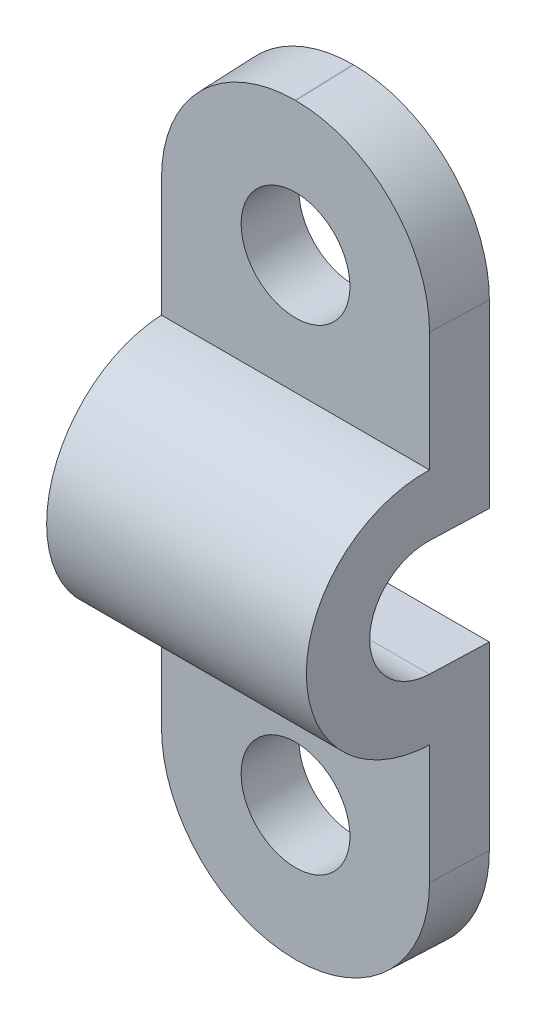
ISO-10303-21;
HEADER;
FILE_DESCRIPTION(('STEP AP214'),'2;1');
FILE_NAME('part.step','',(''),(''),'','','');
FILE_SCHEMA(('AUTOMOTIVE_DESIGN { 1 0 10303 214 1 1 1 1 }'));
ENDSEC;
DATA;
#1=APPLICATION_CONTEXT('core data for automotive mechanical design processes');
#2=APPLICATION_PROTOCOL_DEFINITION('international standard','automotive_design',2000,#1);
#3=PRODUCT_CONTEXT('',#1,'mechanical');
#4=PRODUCT('Part','Part','',(#3));
#5=PRODUCT_RELATED_PRODUCT_CATEGORY('part','',(#4));
#6=PRODUCT_DEFINITION_FORMATION('','',#4);
#7=PRODUCT_DEFINITION_CONTEXT('part definition',#1,'design');
#8=PRODUCT_DEFINITION('design','',#6,#7);
#9=PRODUCT_DEFINITION_SHAPE('','',#8);
#10=(LENGTH_UNIT() NAMED_UNIT(*) SI_UNIT(.MILLI.,.METRE.));
#11=(NAMED_UNIT(*) PLANE_ANGLE_UNIT() SI_UNIT($,.RADIAN.));
#12=(NAMED_UNIT(*) SI_UNIT($,.STERADIAN.) SOLID_ANGLE_UNIT());
#13=UNCERTAINTY_MEASURE_WITH_UNIT(LENGTH_MEASURE(1.E-05),#10,'distance_accuracy_value','');
#14=(GEOMETRIC_REPRESENTATION_CONTEXT(3) GLOBAL_UNCERTAINTY_ASSIGNED_CONTEXT((#13)) GLOBAL_UNIT_ASSIGNED_CONTEXT((#10,
#11,#12)) REPRESENTATION_CONTEXT('',''));
#15=CARTESIAN_POINT('',(0.,0.,0.));
#16=DIRECTION('',(0.,0.,1.));
#17=DIRECTION('',(1.,0.,0.));
#18=AXIS2_PLACEMENT_3D('',#15,#16,#17);
#19=CARTESIAN_POINT('',(94.47,-118.59,1.7085));
#20=DIRECTION('',(0.,0.,-1.));
#21=DIRECTION('',(-1.,0.,0.));
#22=AXIS2_PLACEMENT_3D('',#19,#20,#21);
#23=PLANE('',#22);
#24=DIRECTION('',(1.,0.,0.));
#25=VECTOR('',#24,1.);
#26=CARTESIAN_POINT('',(94.47,-118.530337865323,1.7085));
#27=LINE('',#26,#25);
#28=CARTESIAN_POINT('',(90.46005,-118.530337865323,1.7085));
#29=VERTEX_POINT('',#28);
#30=CARTESIAN_POINT('',(90.43995,-118.530337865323,1.7085));
#31=VERTEX_POINT('',#30);
#32=EDGE_CURVE('E196',#29,#31,#27,.F.);
#33=ORIENTED_EDGE('',*,*,#32,.F.);
#34=CARTESIAN_POINT('',(90.46005,-114.58005,1.7085));
#35=DIRECTION('',(0.,0.,-1.));
#36=DIRECTION('',(-1.,0.,0.));
#37=AXIS2_PLACEMENT_3D('',#34,#35,#36);
#38=CIRCLE('',#37,3.95028786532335);
#39=CARTESIAN_POINT('',(94.4103378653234,-114.58005,1.7085));
#40=VERTEX_POINT('',#39);
#41=EDGE_CURVE('E235',#29,#40,#38,.F.);
#42=ORIENTED_EDGE('',*,*,#41,.T.);
#43=DIRECTION('',(0.,-1.,0.));
#44=VECTOR('',#43,1.);
#45=CARTESIAN_POINT('',(94.4103378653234,-118.59,1.7085));
#46=LINE('',#45,#44);
#47=CARTESIAN_POINT('',(94.4103378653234,-111.0525,1.7085));
#48=VERTEX_POINT('',#47);
#49=EDGE_CURVE('E166',#48,#40,#46,.T.);
#50=ORIENTED_EDGE('',*,*,#49,.F.);
#51=DIRECTION('',(-1.,0.,0.));
#52=VECTOR('',#51,1.);
#53=CARTESIAN_POINT('',(94.47,-111.0525,1.7085));
#54=LINE('',#53,#52);
#55=CARTESIAN_POINT('',(86.4896621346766,-111.0525,1.7085));
#56=VERTEX_POINT('',#55);
#57=EDGE_CURVE('E269',#48,#56,#54,.T.);
#58=ORIENTED_EDGE('',*,*,#57,.T.);
#59=DIRECTION('',(0.,1.,0.));
#60=VECTOR('',#59,1.);
#61=CARTESIAN_POINT('',(86.4896621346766,-118.59,1.7085));
#62=LINE('',#61,#60);
#63=CARTESIAN_POINT('',(86.4896621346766,-114.58005,1.7085));
#64=VERTEX_POINT('',#63);
#65=EDGE_CURVE('E201',#56,#64,#62,.F.);
#66=ORIENTED_EDGE('',*,*,#65,.T.);
#67=CARTESIAN_POINT('',(90.43995,-114.58005,1.7085));
#68=DIRECTION('',(0.,0.,-1.));
#69=DIRECTION('',(-1.,0.,0.));
#70=AXIS2_PLACEMENT_3D('',#67,#68,#69);
#71=CIRCLE('',#70,3.95028786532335);
#72=EDGE_CURVE('E220',#64,#31,#71,.F.);
#73=ORIENTED_EDGE('',*,*,#72,.T.);
#74=EDGE_LOOP('',(#33,#42,#50,#58,#66,#73));
#75=FACE_BOUND('',#74,.T.);
#76=CARTESIAN_POINT('',(90.45,-114.57,1.7085));
#77=DIRECTION('',(0.,0.,-1.));
#78=DIRECTION('',(-1.,0.,0.));
#79=AXIS2_PLACEMENT_3D('',#76,#77,#78);
#80=CIRCLE('',#79,1.608);
#81=CARTESIAN_POINT('',(88.842,-114.57,1.7085));
#82=VERTEX_POINT('',#81);
#83=EDGE_CURVE('E422',#82,#82,#80,.F.);
#84=ORIENTED_EDGE('',*,*,#83,.F.);
#85=EDGE_LOOP('',(#84));
#86=FACE_BOUND('',#85,.T.);
#87=ADVANCED_FACE('F16',(#75,#86),#23,.F.);
#88=CARTESIAN_POINT('',(94.47,-118.59,0.));
#89=DIRECTION('',(0.,0.,1.));
#90=DIRECTION('',(1.,0.,0.));
#91=AXIS2_PLACEMENT_3D('',#88,#89,#90);
#92=PLANE('',#91);
#93=DIRECTION('',(0.,1.,0.));
#94=VECTOR('',#93,1.);
#95=CARTESIAN_POINT('',(94.47,-118.59,0.));
#96=LINE('',#95,#94);
#97=CARTESIAN_POINT('',(94.47,-114.58005,0.));
#98=VERTEX_POINT('',#97);
#99=CARTESIAN_POINT('',(94.47,-109.2435,0.));
#100=VERTEX_POINT('',#99);
#101=EDGE_CURVE('E189',#98,#100,#96,.T.);
#102=ORIENTED_EDGE('',*,*,#101,.F.);
#103=CARTESIAN_POINT('',(90.46005,-114.58005,0.));
#104=DIRECTION('',(0.,0.,1.));
#105=DIRECTION('',(1.,0.,0.));
#106=AXIS2_PLACEMENT_3D('',#103,#104,#105);
#107=CIRCLE('',#106,4.00995);
#108=CARTESIAN_POINT('',(90.46005,-118.59,0.));
#109=VERTEX_POINT('',#108);
#110=EDGE_CURVE('E238',#98,#109,#107,.F.);
#111=ORIENTED_EDGE('',*,*,#110,.T.);
#112=DIRECTION('',(1.,0.,0.));
#113=VECTOR('',#112,1.);
#114=CARTESIAN_POINT('',(94.47,-118.59,0.));
#115=LINE('',#114,#113);
#116=CARTESIAN_POINT('',(90.43995,-118.59,0.));
#117=VERTEX_POINT('',#116);
#118=EDGE_CURVE('E192',#109,#117,#115,.F.);
#119=ORIENTED_EDGE('',*,*,#118,.T.);
#120=CARTESIAN_POINT('',(90.43995,-114.58005,0.));
#121=DIRECTION('',(0.,0.,1.));
#122=DIRECTION('',(1.,0.,0.));
#123=AXIS2_PLACEMENT_3D('',#120,#121,#122);
#124=CIRCLE('',#123,4.00995);
#125=CARTESIAN_POINT('',(86.43,-114.58005,0.));
#126=VERTEX_POINT('',#125);
#127=EDGE_CURVE('E248',#117,#126,#124,.F.);
#128=ORIENTED_EDGE('',*,*,#127,.T.);
#129=DIRECTION('',(0.,-1.,0.));
#130=VECTOR('',#129,1.);
#131=CARTESIAN_POINT('',(86.43,-118.59,0.));
#132=LINE('',#131,#130);
#133=CARTESIAN_POINT('',(86.43,-109.2435,0.));
#134=VERTEX_POINT('',#133);
#135=EDGE_CURVE('E198',#126,#134,#132,.F.);
#136=ORIENTED_EDGE('',*,*,#135,.T.);
#137=DIRECTION('',(-1.,0.,0.));
#138=VECTOR('',#137,1.);
#139=CARTESIAN_POINT('',(94.47,-109.2435,0.));
#140=LINE('',#139,#138);
#141=EDGE_CURVE('E197',#100,#134,#140,.T.);
#142=ORIENTED_EDGE('',*,*,#141,.F.);
#143=EDGE_LOOP('',(#102,#111,#119,#128,#136,#142));
#144=FACE_BOUND('',#143,.T.);
#145=CARTESIAN_POINT('',(90.45,-114.57,0.));
#146=DIRECTION('',(0.,0.,1.));
#147=DIRECTION('',(-1.,0.,0.));
#148=AXIS2_PLACEMENT_3D('',#145,#146,#147);
#149=CIRCLE('',#148,1.608);
#150=CARTESIAN_POINT('',(88.842,-114.57,0.));
#151=VERTEX_POINT('',#150);
#152=EDGE_CURVE('E431',#151,#151,#149,.T.);
#153=ORIENTED_EDGE('',*,*,#152,.T.);
#154=EDGE_LOOP('',(#153));
#155=FACE_BOUND('',#154,.T.);
#156=ADVANCED_FACE('F585',(#144,#155),#92,.F.);
#157=CARTESIAN_POINT('',(94.47,-105.8265,0.));
#158=DIRECTION('',(0.,0.,1.));
#159=DIRECTION('',(1.,0.,0.));
#160=AXIS2_PLACEMENT_3D('',#157,#158,#159);
#161=PLANE('',#160);
#162=DIRECTION('',(1.,0.,0.));
#163=VECTOR('',#162,1.);
#164=CARTESIAN_POINT('',(94.47,-96.48,0.));
#165=LINE('',#164,#163);
#166=CARTESIAN_POINT('',(90.46005,-96.48,0.));
#167=VERTEX_POINT('',#166);
#168=CARTESIAN_POINT('',(90.43995,-96.48,0.));
#169=VERTEX_POINT('',#168);
#170=EDGE_CURVE('E173',#167,#169,#165,.F.);
#171=ORIENTED_EDGE('',*,*,#170,.F.);
#172=CARTESIAN_POINT('',(90.46005,-100.48995,0.));
#173=DIRECTION('',(0.,0.,1.));
#174=DIRECTION('',(1.,0.,0.));
#175=AXIS2_PLACEMENT_3D('',#172,#173,#174);
#176=CIRCLE('',#175,4.00995);
#177=CARTESIAN_POINT('',(94.47,-100.48995,0.));
#178=VERTEX_POINT('',#177);
#179=EDGE_CURVE('E11',#167,#178,#176,.F.);
#180=ORIENTED_EDGE('',*,*,#179,.T.);
#181=DIRECTION('',(0.,1.,0.));
#182=VECTOR('',#181,1.);
#183=CARTESIAN_POINT('',(94.47,-105.8265,0.));
#184=LINE('',#183,#182);
#185=CARTESIAN_POINT('',(94.47,-105.8265,0.));
#186=VERTEX_POINT('',#185);
#187=EDGE_CURVE('E143',#186,#178,#184,.T.);
#188=ORIENTED_EDGE('',*,*,#187,.F.);
#189=DIRECTION('',(-1.,0.,0.));
#190=VECTOR('',#189,1.);
#191=CARTESIAN_POINT('',(94.47,-105.8265,0.));
#192=LINE('',#191,#190);
#193=CARTESIAN_POINT('',(86.43,-105.8265,0.));
#194=VERTEX_POINT('',#193);
#195=EDGE_CURVE('E175',#186,#194,#192,.T.);
#196=ORIENTED_EDGE('',*,*,#195,.T.);
#197=DIRECTION('',(0.,-1.,0.));
#198=VECTOR('',#197,1.);
#199=CARTESIAN_POINT('',(86.43,-105.8265,0.));
#200=LINE('',#199,#198);
#201=CARTESIAN_POINT('',(86.43,-100.48995,0.));
#202=VERTEX_POINT('',#201);
#203=EDGE_CURVE('E212',#194,#202,#200,.F.);
#204=ORIENTED_EDGE('',*,*,#203,.T.);
#205=CARTESIAN_POINT('',(90.43995,-100.48995,0.));
#206=DIRECTION('',(0.,0.,1.));
#207=DIRECTION('',(1.,0.,0.));
#208=AXIS2_PLACEMENT_3D('',#205,#206,#207);
#209=CIRCLE('',#208,4.00995);
#210=EDGE_CURVE('E26',#202,#169,#209,.F.);
#211=ORIENTED_EDGE('',*,*,#210,.T.);
#212=EDGE_LOOP('',(#171,#180,#188,#196,#204,#211));
#213=FACE_BOUND('',#212,.T.);
#214=CARTESIAN_POINT('',(90.45,-100.5,0.));
#215=DIRECTION('',(0.,0.,1.));
#216=DIRECTION('',(1.,0.,0.));
#217=AXIS2_PLACEMENT_3D('',#214,#215,#216);
#218=CIRCLE('',#217,1.608);
#219=CARTESIAN_POINT('',(92.058,-100.5,0.));
#220=VERTEX_POINT('',#219);
#221=EDGE_CURVE('E430',#220,#220,#218,.T.);
#222=ORIENTED_EDGE('',*,*,#221,.T.);
#223=EDGE_LOOP('',(#222));
#224=FACE_BOUND('',#223,.T.);
#225=ADVANCED_FACE('F600',(#213,#224),#161,.F.);
#226=CARTESIAN_POINT('',(94.47,-104.0175,1.7085));
#227=DIRECTION('',(0.,0.,-1.));
#228=DIRECTION('',(-1.,0.,0.));
#229=AXIS2_PLACEMENT_3D('',#226,#227,#228);
#230=PLANE('',#229);
#231=DIRECTION('',(0.,-1.,0.));
#232=VECTOR('',#231,1.);
#233=CARTESIAN_POINT('',(94.4103378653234,-104.0175,1.7085));
#234=LINE('',#233,#232);
#235=CARTESIAN_POINT('',(94.4103378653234,-100.48995,1.7085));
#236=VERTEX_POINT('',#235);
#237=CARTESIAN_POINT('',(94.4103378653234,-104.0175,1.7085));
#238=VERTEX_POINT('',#237);
#239=EDGE_CURVE('E140',#236,#238,#234,.T.);
#240=ORIENTED_EDGE('',*,*,#239,.F.);
#241=CARTESIAN_POINT('',(90.46005,-100.48995,1.7085));
#242=DIRECTION('',(0.,0.,-1.));
#243=DIRECTION('',(-1.,0.,0.));
#244=AXIS2_PLACEMENT_3D('',#241,#242,#243);
#245=CIRCLE('',#244,3.95028786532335);
#246=CARTESIAN_POINT('',(90.46005,-96.5396621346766,1.7085));
#247=VERTEX_POINT('',#246);
#248=EDGE_CURVE('E127',#236,#247,#245,.F.);
#249=ORIENTED_EDGE('',*,*,#248,.T.);
#250=DIRECTION('',(1.,0.,0.));
#251=VECTOR('',#250,1.);
#252=CARTESIAN_POINT('',(94.47,-96.5396621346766,1.7085));
#253=LINE('',#252,#251);
#254=CARTESIAN_POINT('',(90.43995,-96.5396621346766,1.7085));
#255=VERTEX_POINT('',#254);
#256=EDGE_CURVE('E176',#247,#255,#253,.F.);
#257=ORIENTED_EDGE('',*,*,#256,.T.);
#258=CARTESIAN_POINT('',(90.43995,-100.48995,1.7085));
#259=DIRECTION('',(0.,0.,-1.));
#260=DIRECTION('',(-1.,0.,0.));
#261=AXIS2_PLACEMENT_3D('',#258,#259,#260);
#262=CIRCLE('',#261,3.95028786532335);
#263=CARTESIAN_POINT('',(86.4896621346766,-100.48995,1.7085));
#264=VERTEX_POINT('',#263);
#265=EDGE_CURVE('E107',#255,#264,#262,.F.);
#266=ORIENTED_EDGE('',*,*,#265,.T.);
#267=DIRECTION('',(0.,1.,0.));
#268=VECTOR('',#267,1.);
#269=CARTESIAN_POINT('',(86.4896621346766,-104.0175,1.7085));
#270=LINE('',#269,#268);
#271=CARTESIAN_POINT('',(86.4896621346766,-104.0175,1.7085));
#272=VERTEX_POINT('',#271);
#273=EDGE_CURVE('E215',#264,#272,#270,.F.);
#274=ORIENTED_EDGE('',*,*,#273,.T.);
#275=DIRECTION('',(-1.,0.,0.));
#276=VECTOR('',#275,1.);
#277=CARTESIAN_POINT('',(94.47,-104.0175,1.7085));
#278=LINE('',#277,#276);
#279=EDGE_CURVE('E151',#238,#272,#278,.T.);
#280=ORIENTED_EDGE('',*,*,#279,.F.);
#281=EDGE_LOOP('',(#240,#249,#257,#266,#274,#280));
#282=FACE_BOUND('',#281,.T.);
#283=CARTESIAN_POINT('',(90.45,-100.5,1.7085));
#284=DIRECTION('',(0.,0.,-1.));
#285=DIRECTION('',(-1.,0.,0.));
#286=AXIS2_PLACEMENT_3D('',#283,#284,#285);
#287=CIRCLE('',#286,1.608);
#288=CARTESIAN_POINT('',(88.842,-100.5,1.7085));
#289=VERTEX_POINT('',#288);
#290=EDGE_CURVE('E209',#289,#289,#287,.F.);
#291=ORIENTED_EDGE('',*,*,#290,.F.);
#292=EDGE_LOOP('',(#291));
#293=FACE_BOUND('',#292,.T.);
#294=ADVANCED_FACE('F148',(#282,#293),#230,.F.);
#295=CARTESIAN_POINT('',(94.47,-107.535,1.7085));
#296=DIRECTION('',(-1.,0.,0.));
#297=DIRECTION('',(0.,-1.,0.));
#298=AXIS2_PLACEMENT_3D('',#295,#296,#297);
#299=CYLINDRICAL_SURFACE('',#298,1.7085);
#300=CARTESIAN_POINT('',(86.4896621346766,-107.535,1.7085));
#301=DIRECTION('',(-0.999390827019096,0.,0.0348994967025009));
#302=DIRECTION('',(-0.0348994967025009,0.,-0.999390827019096));
#303=AXIS2_PLACEMENT_3D('',#300,#301,#302);
#304=ELLIPSE('',#303,1.70954140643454,1.7085);
#305=CARTESIAN_POINT('',(86.4896621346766,-109.2435,1.7085));
#306=VERTEX_POINT('',#305);
#307=CARTESIAN_POINT('',(86.4896621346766,-105.8265,1.7085));
#308=VERTEX_POINT('',#307);
#309=EDGE_CURVE('E204',#306,#308,#304,.T.);
#310=ORIENTED_EDGE('',*,*,#309,.T.);
#311=DIRECTION('',(-1.,0.,0.));
#312=VECTOR('',#311,1.);
#313=CARTESIAN_POINT('',(94.47,-105.8265,1.7085));
#314=LINE('',#313,#312);
#315=CARTESIAN_POINT('',(94.4103378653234,-105.8265,1.7085));
#316=VERTEX_POINT('',#315);
#317=EDGE_CURVE('E146',#316,#308,#314,.T.);
#318=ORIENTED_EDGE('',*,*,#317,.F.);
#319=CARTESIAN_POINT('',(94.4103378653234,-107.535,1.7085));
#320=DIRECTION('',(0.999390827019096,0.,0.0348994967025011));
#321=DIRECTION('',(-0.0348994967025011,0.,0.999390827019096));
#322=AXIS2_PLACEMENT_3D('',#319,#320,#321);
#323=ELLIPSE('',#322,1.70954140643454,1.7085);
#324=CARTESIAN_POINT('',(94.4103378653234,-109.2435,1.7085));
#325=VERTEX_POINT('',#324);
#326=EDGE_CURVE('E180',#325,#316,#323,.F.);
#327=ORIENTED_EDGE('',*,*,#326,.F.);
#328=DIRECTION('',(-1.,0.,0.));
#329=VECTOR('',#328,1.);
#330=CARTESIAN_POINT('',(94.47,-109.2435,1.7085));
#331=LINE('',#330,#329);
#332=EDGE_CURVE('E188',#325,#306,#331,.T.);
#333=ORIENTED_EDGE('',*,*,#332,.T.);
#334=EDGE_LOOP('',(#310,#318,#327,#333));
#335=FACE_BOUND('',#334,.T.);
#336=ADVANCED_FACE('F612',(#335),#299,.F.);
#337=CARTESIAN_POINT('',(94.47,-105.8265,1.7085));
#338=DIRECTION('',(0.,1.,0.));
#339=DIRECTION('',(0.,0.,1.));
#340=AXIS2_PLACEMENT_3D('',#337,#338,#339);
#341=PLANE('',#340);
#342=DIRECTION('',(0.0348994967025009,0.,0.999390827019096));
#343=VECTOR('',#342,1.);
#344=CARTESIAN_POINT('',(86.4993819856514,-105.8265,1.98684011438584));
#345=LINE('',#344,#343);
#346=EDGE_CURVE('E208',#308,#194,#345,.F.);
#347=ORIENTED_EDGE('',*,*,#346,.T.);
#348=ORIENTED_EDGE('',*,*,#195,.F.);
#349=DIRECTION('',(0.0348994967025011,0.,-0.999390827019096));
#350=VECTOR('',#349,1.);
#351=CARTESIAN_POINT('',(94.4104105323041,-105.8265,1.70641908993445));
#352=LINE('',#351,#350);
#353=EDGE_CURVE('E169',#316,#186,#352,.T.);
#354=ORIENTED_EDGE('',*,*,#353,.F.);
#355=ORIENTED_EDGE('',*,*,#317,.T.);
#356=EDGE_LOOP('',(#347,#348,#354,#355));
#357=FACE_BOUND('',#356,.T.);
#358=ADVANCED_FACE('F615',(#357),#341,.F.);
#359=CARTESIAN_POINT('',(94.47,-96.48,0.));
#360=DIRECTION('',(0.,0.999390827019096,0.034899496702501));
#361=DIRECTION('',(0.,-0.034899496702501,0.999390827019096));
#362=AXIS2_PLACEMENT_3D('',#359,#360,#361);
#363=PLANE('',#362);
#364=ORIENTED_EDGE('',*,*,#256,.F.);
#365=DIRECTION('',(0.,0.034899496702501,-0.999390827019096));
#366=VECTOR('',#365,1.);
#367=CARTESIAN_POINT('',(90.46005,-96.48,0.));
#368=LINE('',#367,#366);
#369=EDGE_CURVE('E41',#247,#167,#368,.T.);
#370=ORIENTED_EDGE('',*,*,#369,.T.);
#371=ORIENTED_EDGE('',*,*,#170,.T.);
#372=DIRECTION('',(0.,0.034899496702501,-0.999390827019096));
#373=VECTOR('',#372,1.);
#374=CARTESIAN_POINT('',(90.43995,-96.48,0.));
#375=LINE('',#374,#373);
#376=EDGE_CURVE('E134',#169,#255,#375,.F.);
#377=ORIENTED_EDGE('',*,*,#376,.T.);
#378=EDGE_LOOP('',(#364,#370,#371,#377));
#379=FACE_BOUND('',#378,.T.);
#380=ADVANCED_FACE('F608',(#379),#363,.T.);
#381=CARTESIAN_POINT('',(94.47,-107.535,1.7085));
#382=DIRECTION('',(-1.,0.,0.));
#383=DIRECTION('',(0.,-1.,0.));
#384=AXIS2_PLACEMENT_3D('',#381,#382,#383);
#385=CYLINDRICAL_SURFACE('',#384,3.5175);
#386=CARTESIAN_POINT('',(86.4896621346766,-107.535,1.7085));
#387=DIRECTION('',(-0.999390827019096,0.,0.0348994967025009));
#388=DIRECTION('',(-0.0348994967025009,0.,-0.999390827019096));
#389=AXIS2_PLACEMENT_3D('',#386,#387,#388);
#390=ELLIPSE('',#389,3.51964407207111,3.5175);
#391=EDGE_CURVE('E261',#272,#56,#390,.F.);
#392=ORIENTED_EDGE('',*,*,#391,.T.);
#393=ORIENTED_EDGE('',*,*,#57,.F.);
#394=CARTESIAN_POINT('',(94.4103378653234,-107.535,1.7085));
#395=DIRECTION('',(0.999390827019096,0.,0.0348994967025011));
#396=DIRECTION('',(-0.0348994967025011,0.,0.999390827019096));
#397=AXIS2_PLACEMENT_3D('',#394,#395,#396);
#398=ELLIPSE('',#397,3.51964407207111,3.5175);
#399=EDGE_CURVE('E154',#238,#48,#398,.T.);
#400=ORIENTED_EDGE('',*,*,#399,.F.);
#401=ORIENTED_EDGE('',*,*,#279,.T.);
#402=EDGE_LOOP('',(#392,#393,#400,#401));
#403=FACE_BOUND('',#402,.T.);
#404=ADVANCED_FACE('F604',(#403),#385,.T.);
#405=CARTESIAN_POINT('',(94.47,-118.59,0.));
#406=DIRECTION('',(0.,-0.999390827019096,0.034899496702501));
#407=DIRECTION('',(0.,-0.034899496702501,-0.999390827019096));
#408=AXIS2_PLACEMENT_3D('',#405,#406,#407);
#409=PLANE('',#408);
#410=ORIENTED_EDGE('',*,*,#118,.F.);
#411=DIRECTION('',(0.,-0.034899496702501,-0.999390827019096));
#412=VECTOR('',#411,1.);
#413=CARTESIAN_POINT('',(90.46005,-118.59,0.));
#414=LINE('',#413,#412);
#415=EDGE_CURVE('E218',#109,#29,#414,.F.);
#416=ORIENTED_EDGE('',*,*,#415,.T.);
#417=ORIENTED_EDGE('',*,*,#32,.T.);
#418=DIRECTION('',(0.,-0.034899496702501,-0.999390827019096));
#419=VECTOR('',#418,1.);
#420=CARTESIAN_POINT('',(90.43995,-118.59,0.));
#421=LINE('',#420,#419);
#422=EDGE_CURVE('E221',#31,#117,#421,.T.);
#423=ORIENTED_EDGE('',*,*,#422,.T.);
#424=EDGE_LOOP('',(#410,#416,#417,#423));
#425=FACE_BOUND('',#424,.T.);
#426=ADVANCED_FACE('F607',(#425),#409,.T.);
#427=CARTESIAN_POINT('',(94.47,-109.2435,1.7085));
#428=DIRECTION('',(0.,-1.,0.));
#429=DIRECTION('',(0.,0.,-1.));
#430=AXIS2_PLACEMENT_3D('',#427,#428,#429);
#431=PLANE('',#430);
#432=DIRECTION('',(-0.0348994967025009,0.,-0.999390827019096));
#433=VECTOR('',#432,1.);
#434=CARTESIAN_POINT('',(86.4993819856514,-109.2435,1.98684011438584));
#435=LINE('',#434,#433);
#436=EDGE_CURVE('E184',#134,#306,#435,.F.);
#437=ORIENTED_EDGE('',*,*,#436,.T.);
#438=ORIENTED_EDGE('',*,*,#332,.F.);
#439=DIRECTION('',(-0.0348994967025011,0.,0.999390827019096));
#440=VECTOR('',#439,1.);
#441=CARTESIAN_POINT('',(94.4104105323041,-109.2435,1.70641908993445));
#442=LINE('',#441,#440);
#443=EDGE_CURVE('E185',#100,#325,#442,.T.);
#444=ORIENTED_EDGE('',*,*,#443,.F.);
#445=ORIENTED_EDGE('',*,*,#141,.T.);
#446=EDGE_LOOP('',(#437,#438,#444,#445));
#447=FACE_BOUND('',#446,.T.);
#448=ADVANCED_FACE('F626',(#447),#431,.F.);
#449=CARTESIAN_POINT('',(94.47,-105.8265,0.));
#450=DIRECTION('',(0.999390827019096,0.,0.0348994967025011));
#451=DIRECTION('',(0.0348994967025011,0.,-0.999390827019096));
#452=AXIS2_PLACEMENT_3D('',#449,#450,#451);
#453=PLANE('',#452);
#454=ORIENTED_EDGE('',*,*,#49,.T.);
#455=DIRECTION('',(0.0348994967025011,0.,-0.999390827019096));
#456=VECTOR('',#455,1.);
#457=CARTESIAN_POINT('',(94.47,-114.58005,0.));
#458=LINE('',#457,#456);
#459=EDGE_CURVE('E145',#40,#98,#458,.T.);
#460=ORIENTED_EDGE('',*,*,#459,.T.);
#461=ORIENTED_EDGE('',*,*,#101,.T.);
#462=ORIENTED_EDGE('',*,*,#443,.T.);
#463=ORIENTED_EDGE('',*,*,#326,.T.);
#464=ORIENTED_EDGE('',*,*,#353,.T.);
#465=ORIENTED_EDGE('',*,*,#187,.T.);
#466=DIRECTION('',(0.0348994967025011,0.,-0.999390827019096));
#467=VECTOR('',#466,1.);
#468=CARTESIAN_POINT('',(94.47,-100.48995,0.));
#469=LINE('',#468,#467);
#470=EDGE_CURVE('E131',#178,#236,#469,.F.);
#471=ORIENTED_EDGE('',*,*,#470,.T.);
#472=ORIENTED_EDGE('',*,*,#239,.T.);
#473=ORIENTED_EDGE('',*,*,#399,.T.);
#474=EDGE_LOOP('',(#454,#460,#461,#462,#463,#464,#465,#471,#472,#473));
#475=FACE_BOUND('',#474,.T.);
#476=ADVANCED_FACE('F139',(#475),#453,.T.);
#477=CARTESIAN_POINT('',(86.43,-105.8265,0.));
#478=DIRECTION('',(-0.999390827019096,0.,0.0348994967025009));
#479=DIRECTION('',(0.0348994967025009,0.,0.999390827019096));
#480=AXIS2_PLACEMENT_3D('',#477,#478,#479);
#481=PLANE('',#480);
#482=ORIENTED_EDGE('',*,*,#135,.F.);
#483=DIRECTION('',(-0.0348994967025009,0.,-0.999390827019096));
#484=VECTOR('',#483,1.);
#485=CARTESIAN_POINT('',(86.43,-114.58005,0.));
#486=LINE('',#485,#484);
#487=EDGE_CURVE('E20',#126,#64,#486,.F.);
#488=ORIENTED_EDGE('',*,*,#487,.T.);
#489=ORIENTED_EDGE('',*,*,#65,.F.);
#490=ORIENTED_EDGE('',*,*,#391,.F.);
#491=ORIENTED_EDGE('',*,*,#273,.F.);
#492=DIRECTION('',(-0.0348994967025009,0.,-0.999390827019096));
#493=VECTOR('',#492,1.);
#494=CARTESIAN_POINT('',(86.43,-100.48995,0.));
#495=LINE('',#494,#493);
#496=EDGE_CURVE('E99',#264,#202,#495,.T.);
#497=ORIENTED_EDGE('',*,*,#496,.T.);
#498=ORIENTED_EDGE('',*,*,#203,.F.);
#499=ORIENTED_EDGE('',*,*,#346,.F.);
#500=ORIENTED_EDGE('',*,*,#309,.F.);
#501=ORIENTED_EDGE('',*,*,#436,.F.);
#502=EDGE_LOOP('',(#482,#488,#489,#490,#491,#497,#498,#499,#500,#501));
#503=FACE_BOUND('',#502,.T.);
#504=ADVANCED_FACE('F18',(#503),#481,.T.);
#505=CARTESIAN_POINT('',(90.45,-100.5,5.226));
#506=DIRECTION('',(0.,0.,-1.));
#507=DIRECTION('',(-1.,0.,0.));
#508=AXIS2_PLACEMENT_3D('',#505,#506,#507);
#509=CYLINDRICAL_SURFACE('',#508,1.608);
#510=ORIENTED_EDGE('',*,*,#221,.F.);
#511=EDGE_LOOP('',(#510));
#512=FACE_BOUND('',#511,.T.);
#513=ORIENTED_EDGE('',*,*,#290,.T.);
#514=EDGE_LOOP('',(#513));
#515=FACE_BOUND('',#514,.T.);
#516=ADVANCED_FACE('F590',(#512,#515),#509,.F.);
#517=CARTESIAN_POINT('',(90.45,-114.57,5.226));
#518=DIRECTION('',(0.,0.,-1.));
#519=DIRECTION('',(-1.,0.,0.));
#520=AXIS2_PLACEMENT_3D('',#517,#518,#519);
#521=CYLINDRICAL_SURFACE('',#520,1.608);
#522=ORIENTED_EDGE('',*,*,#152,.F.);
#523=EDGE_LOOP('',(#522));
#524=FACE_BOUND('',#523,.T.);
#525=ORIENTED_EDGE('',*,*,#83,.T.);
#526=EDGE_LOOP('',(#525));
#527=FACE_BOUND('',#526,.T.);
#528=ADVANCED_FACE('F587',(#524,#527),#521,.F.);
#529=CARTESIAN_POINT('',(90.46005,-114.58005,0.));
#530=DIRECTION('',(0.,0.,-1.));
#531=DIRECTION('',(1.,0.,0.));
#532=AXIS2_PLACEMENT_3D('',#529,#530,#531);
#533=CONICAL_SURFACE('',#532,4.00995,0.0349065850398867);
#534=ORIENTED_EDGE('',*,*,#41,.F.);
#535=ORIENTED_EDGE('',*,*,#415,.F.);
#536=ORIENTED_EDGE('',*,*,#110,.F.);
#537=ORIENTED_EDGE('',*,*,#459,.F.);
#538=EDGE_LOOP('',(#534,#535,#536,#537));
#539=FACE_BOUND('',#538,.T.);
#540=ADVANCED_FACE('F289',(#539),#533,.T.);
#541=CARTESIAN_POINT('',(90.43995,-114.58005,0.));
#542=DIRECTION('',(0.,0.,-1.));
#543=DIRECTION('',(1.,0.,0.));
#544=AXIS2_PLACEMENT_3D('',#541,#542,#543);
#545=CONICAL_SURFACE('',#544,4.00995,0.0349065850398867);
#546=ORIENTED_EDGE('',*,*,#72,.F.);
#547=ORIENTED_EDGE('',*,*,#487,.F.);
#548=ORIENTED_EDGE('',*,*,#127,.F.);
#549=ORIENTED_EDGE('',*,*,#422,.F.);
#550=EDGE_LOOP('',(#546,#547,#548,#549));
#551=FACE_BOUND('',#550,.T.);
#552=ADVANCED_FACE('F629',(#551),#545,.T.);
#553=CARTESIAN_POINT('',(90.46005,-100.48995,0.));
#554=DIRECTION('',(0.,0.,-1.));
#555=DIRECTION('',(1.,0.,0.));
#556=AXIS2_PLACEMENT_3D('',#553,#554,#555);
#557=CONICAL_SURFACE('',#556,4.00995,0.0349065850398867);
#558=ORIENTED_EDGE('',*,*,#179,.F.);
#559=ORIENTED_EDGE('',*,*,#369,.F.);
#560=ORIENTED_EDGE('',*,*,#248,.F.);
#561=ORIENTED_EDGE('',*,*,#470,.F.);
#562=EDGE_LOOP('',(#558,#559,#560,#561));
#563=FACE_BOUND('',#562,.T.);
#564=ADVANCED_FACE('F130',(#563),#557,.T.);
#565=CARTESIAN_POINT('',(90.43995,-100.48995,0.));
#566=DIRECTION('',(0.,0.,-1.));
#567=DIRECTION('',(1.,0.,0.));
#568=AXIS2_PLACEMENT_3D('',#565,#566,#567);
#569=CONICAL_SURFACE('',#568,4.00995,0.0349065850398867);
#570=ORIENTED_EDGE('',*,*,#210,.F.);
#571=ORIENTED_EDGE('',*,*,#496,.F.);
#572=ORIENTED_EDGE('',*,*,#265,.F.);
#573=ORIENTED_EDGE('',*,*,#376,.F.);
#574=EDGE_LOOP('',(#570,#571,#572,#573));
#575=FACE_BOUND('',#574,.T.);
#576=ADVANCED_FACE('F634',(#575),#569,.T.);
#577=CLOSED_SHELL('',(#87,#156,#225,#294,#336,#358,#380,#404,#426,#448,#476,#504,#516,#528,#540,
#552,#564,#576));
#578=MANIFOLD_SOLID_BREP('B1',#577);
#579=ADVANCED_BREP_SHAPE_REPRESENTATION('',(#18,#578),#14);
#580=SHAPE_DEFINITION_REPRESENTATION(#9,#579);
ENDSEC;
END-ISO-10303-21;
